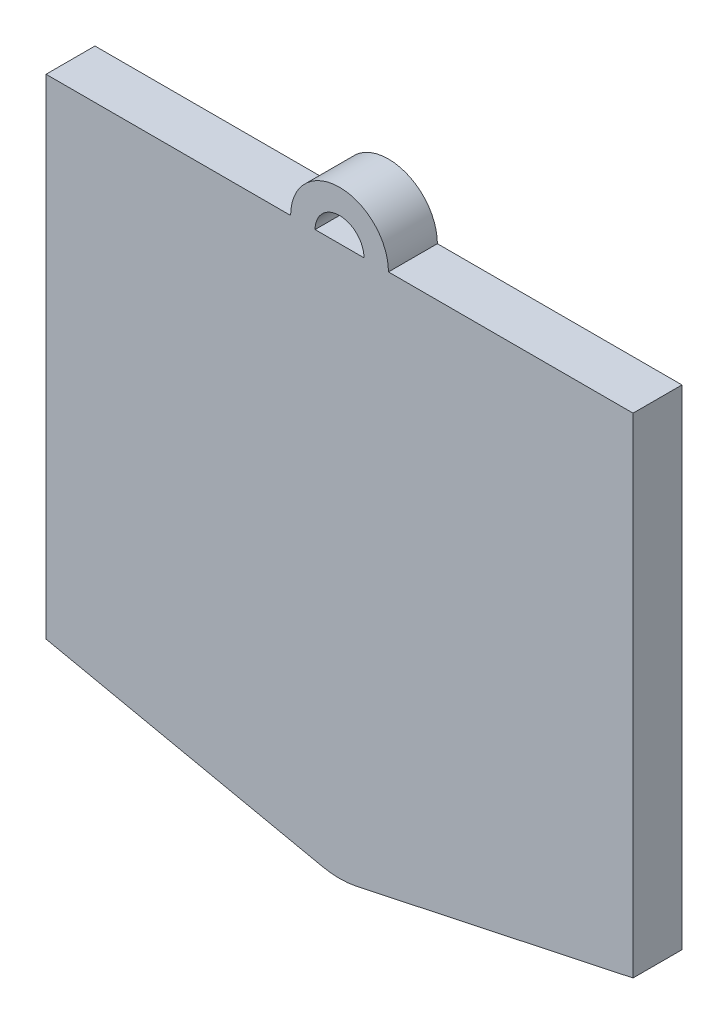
from build123d import *

# Parameters (mm, degrees)
EXTRUDE_1_DEPTH = 3
EXTRUDE_3_DEPTH = 3


with BuildPart() as part:
    # Sketch 1 → Extrude 1 (new body)
    with BuildSketch(Plane.XY):
        with BuildLine():
            Line((-18, 0), (18, 0))
            Line((18, 0), (18, -30))
            Line((18, -30), (1.040412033, -33.607965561))
            ThreePointArc((1.040412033, -33.607965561), (0, -33.717409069), (-1.040412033, -33.607965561))
            Line((-1.040412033, -33.607965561), (-18, -30))
            Line((-18, -30), (-18, 0))
        make_face()
    extrude(amount=EXTRUDE_1_DEPTH)

    # Sketch 2 → Extrude 3 (add)
    with BuildSketch(Plane(origin=(0, 0, 0), x_dir=(-1, 0, 0), z_dir=(0, 0, -1))):
        with BuildLine():
            Line((-3, 0), (-1.5, 0))
            ThreePointArc((-1.5, 0), (0, 1.5), (1.5, 0))
            Line((1.5, 0), (3, 0))
            ThreePointArc((3, 0), (0, 3), (-3, 0))
        make_face()
    extrude(amount=-EXTRUDE_3_DEPTH)


solid = part.part
